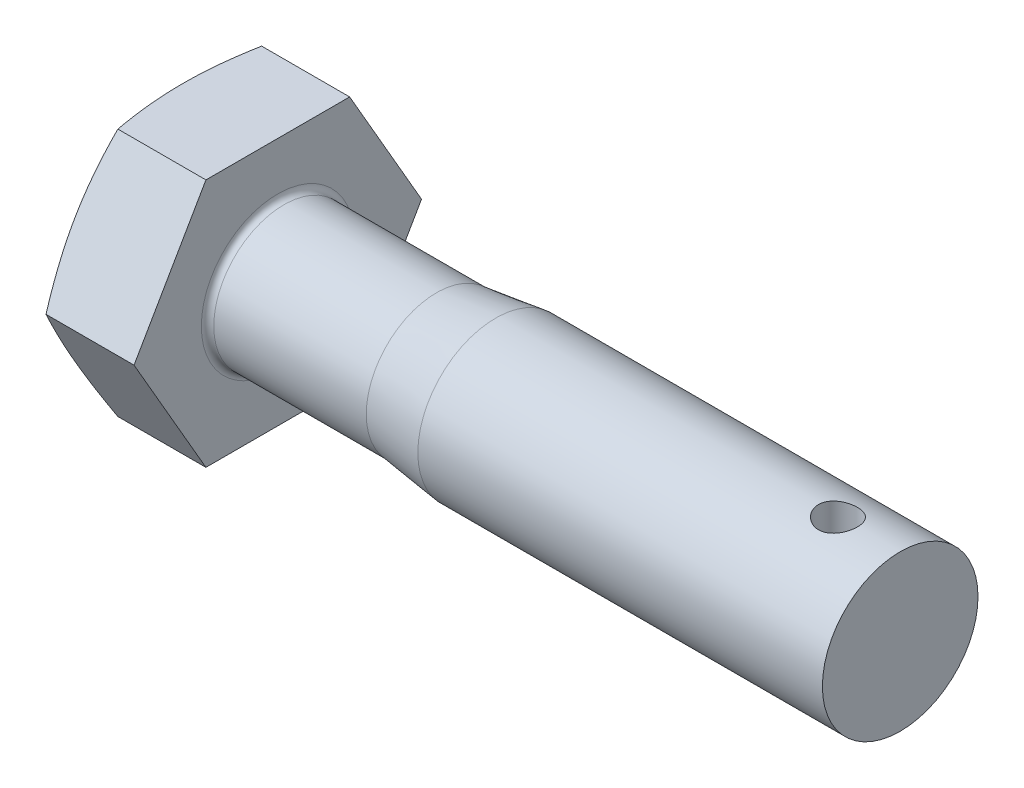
from build123d import *

# Parameters (mm, degrees)
BASEHEAD_DEPTH     = 6.4
SKETCH2_R          = 5
BASEBODY_DEPTH     = 40
SKETCH4_R          = 5.6
CUT_EXTRUDE1_DEPTH = 1.28
HEADFILLET_R       = 0.4
HOLE_DEPTH         = 48.982218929
HOLE_DEPTH_BACK    = 48.982218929
SKETCH6_R          = 1.25


with BuildPart() as part:
    # Sketch1 → BaseHead (new body)
    with BuildSketch(Plane(origin=(0, 0, 0), x_dir=(0, 0, -1), z_dir=(1, 0, 0))):
        Polygon((4.618802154, -8), (9.237604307, 0), (4.618802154, 8), (-4.618802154, 8), (-9.237604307, 0), (-4.618802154, -8), align=None)
    extrude(amount=BASEHEAD_DEPTH)

    # Sketch2 → BaseBody (add)
    with BuildSketch(Plane(origin=(6.4, 0, 0), x_dir=(0, 0, -1), z_dir=(1, 0, 0))):
        with Locations(Location((0, 0, 0), (0, 0, 180))):
            Circle(SKETCH2_R)
    extrude(amount=BASEBODY_DEPTH)

    # Sketch3 → HeadChamfer (revolve, cut)
    with BuildSketch(Plane(origin=(3.161211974, 0, 2.612290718), x_dir=(0, 0, -1), z_dir=(0, 1, 0)), mode=Mode.PRIVATE) as headchamfer_sk:
        Polygon((11.849895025, 3.161211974), (11.849895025, 2.419584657), (9.812290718, 3.161211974), align=None)
    revolve(headchamfer_sk.sketch.rotate(Axis((1.089857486, 0, 0), (1, 0, 0)), 180), axis=Axis((1.089857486, 0, 0), (1, 0, 0)), mode=Mode.SUBTRACT)

    # Sketch4 → Cut-Extrude1 (cut)
    with BuildSketch(Plane(origin=(0, 0, 0), x_dir=(0, 0, -1), z_dir=(1, 0, 0))):
        Circle(SKETCH4_R)
    extrude(amount=CUT_EXTRUDE1_DEPTH, mode=Mode.SUBTRACT)

    # Sketch5 → Cut-Revolve1 (revolve, cut)
    with BuildSketch(Plane(origin=(-2.92963122, 0, 7.92963122), x_dir=(0, 0, -1), z_dir=(0, 1, 0)), mode=Mode.PRIVATE) as cut_revolve1_sk:
        Polygon((12.92963122, -23.32963122), (12.44263122, -19.52963122), (12.44263122, -9.32963122), (16.95563122, -9.32963122), (16.95563122, -23.32963122), align=None)
    revolve(cut_revolve1_sk.sketch.rotate(Axis((0, 0, 0), (1, 0, 0)), 180), axis=Axis((0, 0, 0), (1, 0, 0)), mode=Mode.SUBTRACT)

    # HeadFillet
    headfillet_edges = [part.edges().sort_by_distance(p)[0] for p in [
        (6.4, 0, -4.513),
    ]]
    fillet(headfillet_edges, radius=HEADFILLET_R)

    # Sketch6 → Hole (cut, two sides: drawn at the far end of the back side and taken through both)
    with BuildSketch(Plane(origin=(0, 0, 0), x_dir=(1, 0, 0), z_dir=(0, 1, 0)).offset(-HOLE_DEPTH_BACK)):
        with Locations(Location((42.4, 0, 0), (0, 0, 270))):
            Circle(SKETCH6_R)
    extrude(amount=HOLE_DEPTH + HOLE_DEPTH_BACK, mode=Mode.SUBTRACT)


solid = part.part
